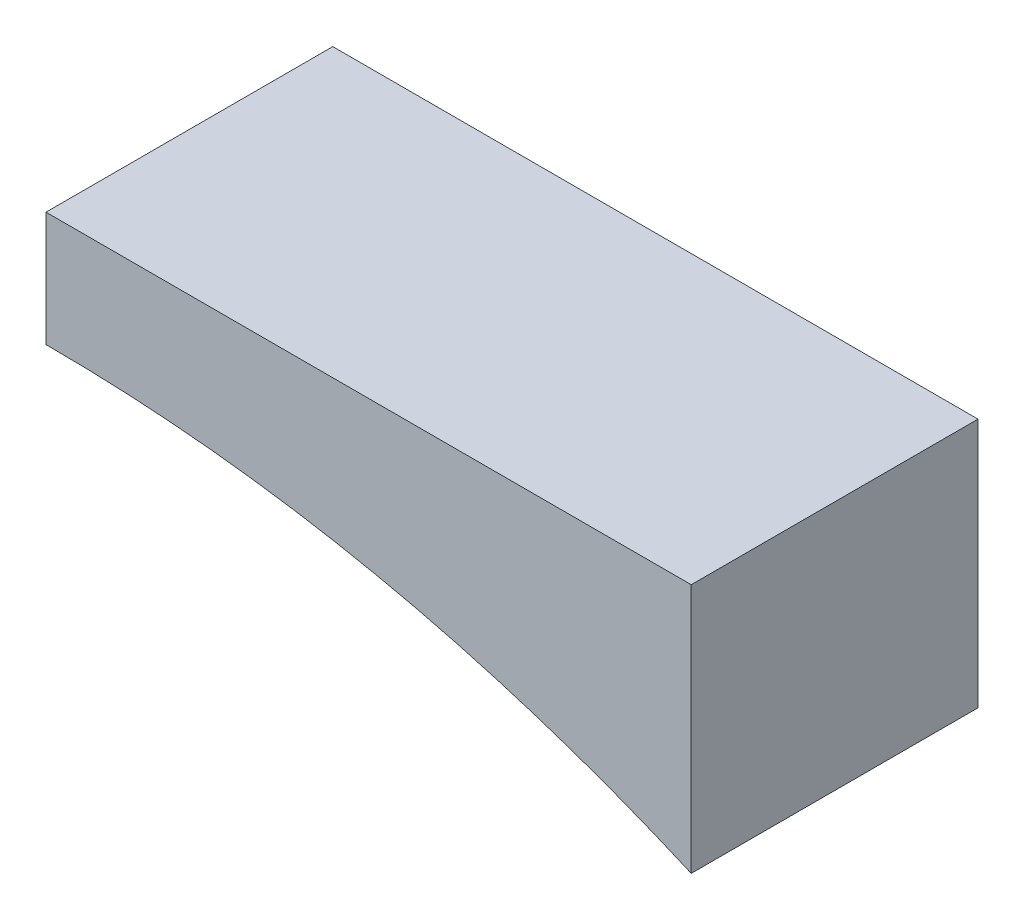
from build123d import *

# Parameters (mm, degrees)
EXTRUSION1_DEPTH = 20


with BuildPart() as part:
    # Esquisse1 → Extrusion1 (new body)
    with BuildSketch(Plane.XY):
        with BuildLine():
            Line((0, 112), (0, 120))
            Line((0, 120), (45, 120))
            Line((45, 120), (45, 102.562176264))
            ThreePointArc((45, 102.562176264), (22.989522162, 109.615153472), (0, 112))
        make_face()
    extrude(amount=EXTRUSION1_DEPTH)


solid = part.part
